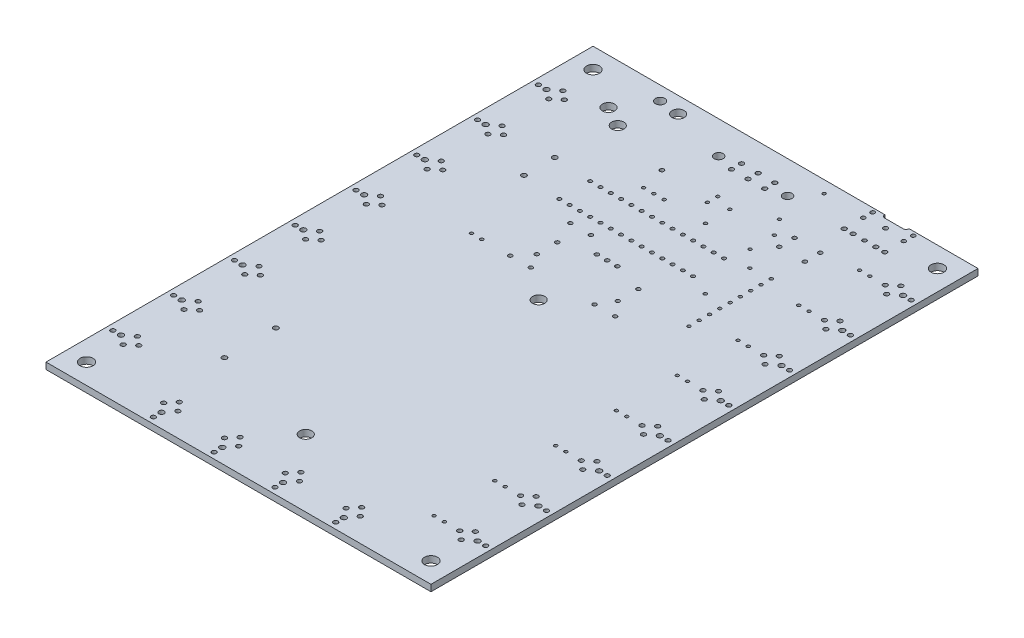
from build123d import *

# Parameters (mm, degrees)
ESQUISSE1_R      = 0.55118
ESQUISSE1_R_2    = 0.65024
ESQUISSE1_R_3    = 0.59944
ESQUISSE1_R_4    = 1.50114
ESQUISSE1_R_5    = 0.50038
ESQUISSE1_R_6    = 0.4826
ESQUISSE1_R_7    = 1.15062
ESQUISSE1_R_8    = 1.6002
ESQUISSE1_R_9    = 0.44958
ESQUISSE1_R_10   = 0.39878
ESQUISSE1_R_11   = 1.09982
EXTRUSION1_DEPTH = 1.6


with BuildPart() as part:
    # Esquisse1 → Extrusion1 (new body)
    with BuildSketch(Plane(origin=(0, 0, 0), x_dir=(1, 0, 0), z_dir=(0, 1, 0))):
        with BuildLine():
            Line((72.74814, 134.2517), (77.24902, 134.2517))
            ThreePointArc((77.24902, 134.2517), (77.77850144, 134.470811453), (77.998319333, 135))
            Line((77.998319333, 135), (95, 135))
            Line((95, 135), (95, 0))
            Line((95, 0), (0, 0))
            Line((0, 0), (0, 135))
            Line((0, 135), (71.998840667, 135))
            ThreePointArc((71.998840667, 135), (72.21865856, 134.470811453), (72.74814, 134.2517))
        make_face()
        with Locations(Location((24.99868, 1.4986, 0), (0, 0, 270))):
            Circle(ESQUISSE1_R, mode=Mode.SUBTRACT)
        with Locations(Location((24.99868, 7.8994, 0), (0, 0, 270))):
            Circle(ESQUISSE1_R, mode=Mode.SUBTRACT)
        with Locations(Location((26.74874, 5.79882, 0), (0, 0, 270))):
            Circle(ESQUISSE1_R, mode=Mode.SUBTRACT)
        with Locations(Location((23.24862, 5.79882, 0), (0, 0, 270))):
            Circle(ESQUISSE1_R, mode=Mode.SUBTRACT)
        with Locations(Location((24.99868, 3.50012, 0), (0, 0, 270))):
            Circle(ESQUISSE1_R_2, mode=Mode.SUBTRACT)
        with Locations(Location((39.99992, 1.4986, 0), (0, 0, 270))):
            Circle(ESQUISSE1_R, mode=Mode.SUBTRACT)
        with Locations(Location((39.99992, 7.8994, 0), (0, 0, 270))):
            Circle(ESQUISSE1_R, mode=Mode.SUBTRACT)
        with Locations(Location((41.74998, 5.79882, 0), (0, 0, 270))):
            Circle(ESQUISSE1_R, mode=Mode.SUBTRACT)
        with Locations(Location((38.24986, 5.79882, 0), (0, 0, 270))):
            Circle(ESQUISSE1_R, mode=Mode.SUBTRACT)
        with Locations(Location((39.99992, 3.50012, 0), (0, 0, 270))):
            Circle(ESQUISSE1_R_2, mode=Mode.SUBTRACT)
        with Locations(Location((54.99862, 1.4986, 0), (0, 0, 270))):
            Circle(ESQUISSE1_R, mode=Mode.SUBTRACT)
        with Locations(Location((54.99862, 7.8994, 0), (0, 0, 270))):
            Circle(ESQUISSE1_R, mode=Mode.SUBTRACT)
        with Locations(Location((56.74868, 5.79882, 0), (0, 0, 270))):
            Circle(ESQUISSE1_R, mode=Mode.SUBTRACT)
        with Locations(Location((53.24856, 5.79882, 0), (0, 0, 270))):
            Circle(ESQUISSE1_R, mode=Mode.SUBTRACT)
        with Locations(Location((54.99862, 3.50012, 0), (0, 0, 270))):
            Circle(ESQUISSE1_R_2, mode=Mode.SUBTRACT)
        with Locations(Location((69.99986, 1.4986, 0), (0, 0, 270))):
            Circle(ESQUISSE1_R, mode=Mode.SUBTRACT)
        with Locations(Location((69.99986, 7.8994, 0), (0, 0, 270))):
            Circle(ESQUISSE1_R, mode=Mode.SUBTRACT)
        with Locations(Location((71.74992, 5.79882, 0), (0, 0, 270))):
            Circle(ESQUISSE1_R, mode=Mode.SUBTRACT)
        with Locations(Location((68.2498, 5.79882, 0), (0, 0, 270))):
            Circle(ESQUISSE1_R, mode=Mode.SUBTRACT)
        with Locations(Location((69.99986, 3.50012, 0), (0, 0, 270))):
            Circle(ESQUISSE1_R_2, mode=Mode.SUBTRACT)
        with Locations(Location((21.07946, 35.6489, 0), (0, 0, 270))):
            Circle(ESQUISSE1_R_3, mode=Mode.SUBTRACT)
        with Locations(Location((21.07946, 22.9489, 0), (0, 0, 270))):
            Circle(ESQUISSE1_R_3, mode=Mode.SUBTRACT)
        with Locations(Location((47.50054, 16.5989, 0), (0, 0, 270))):
            Circle(ESQUISSE1_R_4, mode=Mode.SUBTRACT)
        with Locations(Location((72.1741, 118.90502, 0), (0, 0, 270))):
            Circle(ESQUISSE1_R_5, mode=Mode.SUBTRACT)
        with Locations(Location((72.1741, 115.09502, 0), (0, 0, 270))):
            Circle(ESQUISSE1_R_5, mode=Mode.SUBTRACT)
        with Locations(Location((65.8241, 115.09502, 0), (0, 0, 270))):
            Circle(ESQUISSE1_R_5, mode=Mode.SUBTRACT)
        with Locations(Location((65.8241, 118.90502, 0), (0, 0, 270))):
            Circle(ESQUISSE1_R_5, mode=Mode.SUBTRACT)
        with Locations(Location((40.0939, 94.3864, 0), (0, 0, 270))):
            Circle(ESQUISSE1_R_6, mode=Mode.SUBTRACT)
        with Locations(Location((35.0139, 94.3864, 0), (0, 0, 270))):
            Circle(ESQUISSE1_R_6, mode=Mode.SUBTRACT)
        with Locations(Location((60.452, 79.99222, 0), (0, 0, 270))):
            Circle(ESQUISSE1_R_6, mode=Mode.SUBTRACT)
        with Locations(Location((55.372, 79.99222, 0), (0, 0, 270))):
            Circle(ESQUISSE1_R_6, mode=Mode.SUBTRACT)
        with Locations(Location((34.54654, 80.00746, 0), (0, 0, 270))):
            Circle(ESQUISSE1_R_6, mode=Mode.SUBTRACT)
        with Locations(Location((39.62654, 80.00746, 0), (0, 0, 270))):
            Circle(ESQUISSE1_R_6, mode=Mode.SUBTRACT)
        with Locations(Location((57.50052, 83.59902, 0), (0, 0, 270))):
            Circle(ESQUISSE1_R_6, mode=Mode.SUBTRACT)
        with Locations(Location((57.50052, 88.67902, 0), (0, 0, 270))):
            Circle(ESQUISSE1_R_6, mode=Mode.SUBTRACT)
        with Locations(Location((37.50056, 83.59902, 0), (0, 0, 270))):
            Circle(ESQUISSE1_R_6, mode=Mode.SUBTRACT)
        with Locations(Location((37.50056, 88.67902, 0), (0, 0, 270))):
            Circle(ESQUISSE1_R_6, mode=Mode.SUBTRACT)
        with Locations(Location((19.99996, 121.09958, 0), (0, 0, 270))):
            Circle(ESQUISSE1_R_4, mode=Mode.SUBTRACT)
        with Locations(Location((15.00124, 123.7996, 0), (0, 0, 270))):
            Circle(ESQUISSE1_R_4, mode=Mode.SUBTRACT)
        with Locations(Location((25.00122, 131.0005, 0), (0, 0, 270))):
            Circle(ESQUISSE1_R_4, mode=Mode.SUBTRACT)
        with Locations(Location((19.99996, 131.54914, 0), (0, 0, 270))):
            Circle(ESQUISSE1_R_7, mode=Mode.SUBTRACT)
        with Locations(Location((19.07032, 98.8822, 0), (0, 0, 270))):
            Circle(ESQUISSE1_R_3, mode=Mode.SUBTRACT)
        with Locations(Location((19.07032, 106.5022, 0), (0, 0, 270))):
            Circle(ESQUISSE1_R_3, mode=Mode.SUBTRACT)
        with Locations(Location((5.00126, 5.00126, 0), (0, 0, 270))):
            Circle(ESQUISSE1_R_8, mode=Mode.SUBTRACT)
        with Locations(Location((5.00126, 129.99974, 0), (0, 0, 270))):
            Circle(ESQUISSE1_R_8, mode=Mode.SUBTRACT)
        with Locations(Location((89.99982, 129.99974, 0), (0, 0, 270))):
            Circle(ESQUISSE1_R_8, mode=Mode.SUBTRACT)
        with Locations(Location((89.99982, 5.00126, 0), (0, 0, 270))):
            Circle(ESQUISSE1_R_8, mode=Mode.SUBTRACT)
        with Locations(Location((61.51118, 105.80878, 0), (0, 0, 270))):
            Circle(ESQUISSE1_R_9, mode=Mode.SUBTRACT)
        with Locations(Location((58.97118, 105.80878, 0), (0, 0, 270))):
            Circle(ESQUISSE1_R_9, mode=Mode.SUBTRACT)
        with Locations(Location((56.43118, 105.80878, 0), (0, 0, 270))):
            Circle(ESQUISSE1_R_9, mode=Mode.SUBTRACT)
        with Locations(Location((53.89118, 105.80878, 0), (0, 0, 270))):
            Circle(ESQUISSE1_R_9, mode=Mode.SUBTRACT)
        with Locations(Location((51.35118, 105.80878, 0), (0, 0, 270))):
            Circle(ESQUISSE1_R_9, mode=Mode.SUBTRACT)
        with Locations(Location((48.81118, 105.80878, 0), (0, 0, 270))):
            Circle(ESQUISSE1_R_9, mode=Mode.SUBTRACT)
        with Locations(Location((46.27118, 105.80878, 0), (0, 0, 270))):
            Circle(ESQUISSE1_R_9, mode=Mode.SUBTRACT)
        with Locations(Location((43.73118, 105.80878, 0), (0, 0, 270))):
            Circle(ESQUISSE1_R_9, mode=Mode.SUBTRACT)
        with Locations(Location((41.19118, 105.80878, 0), (0, 0, 270))):
            Circle(ESQUISSE1_R_9, mode=Mode.SUBTRACT)
        with Locations(Location((38.65118, 105.80878, 0), (0, 0, 270))):
            Circle(ESQUISSE1_R_9, mode=Mode.SUBTRACT)
        with Locations(Location((36.11118, 105.80878, 0), (0, 0, 270))):
            Circle(ESQUISSE1_R_9, mode=Mode.SUBTRACT)
        with Locations(Location((33.57118, 105.80878, 0), (0, 0, 270))):
            Circle(ESQUISSE1_R_9, mode=Mode.SUBTRACT)
        with Locations(Location((31.03118, 105.80878, 0), (0, 0, 270))):
            Circle(ESQUISSE1_R_9, mode=Mode.SUBTRACT)
        with Locations(Location((28.49118, 105.80878, 0), (0, 0, 270))):
            Circle(ESQUISSE1_R_9, mode=Mode.SUBTRACT)
        with Locations(Location((28.49118, 98.18878, 0), (0, 0, 270))):
            Circle(ESQUISSE1_R_9, mode=Mode.SUBTRACT)
        with Locations(Location((31.03118, 98.18878, 0), (0, 0, 270))):
            Circle(ESQUISSE1_R_9, mode=Mode.SUBTRACT)
        with Locations(Location((33.57118, 98.18878, 0), (0, 0, 270))):
            Circle(ESQUISSE1_R_9, mode=Mode.SUBTRACT)
        with Locations(Location((36.11118, 98.18878, 0), (0, 0, 270))):
            Circle(ESQUISSE1_R_9, mode=Mode.SUBTRACT)
        with Locations(Location((38.65118, 98.18878, 0), (0, 0, 270))):
            Circle(ESQUISSE1_R_9, mode=Mode.SUBTRACT)
        with Locations(Location((41.19118, 98.18878, 0), (0, 0, 270))):
            Circle(ESQUISSE1_R_9, mode=Mode.SUBTRACT)
        with Locations(Location((43.73118, 98.18878, 0), (0, 0, 270))):
            Circle(ESQUISSE1_R_9, mode=Mode.SUBTRACT)
        with Locations(Location((46.27118, 98.18878, 0), (0, 0, 270))):
            Circle(ESQUISSE1_R_9, mode=Mode.SUBTRACT)
        with Locations(Location((48.81118, 98.18878, 0), (0, 0, 270))):
            Circle(ESQUISSE1_R_9, mode=Mode.SUBTRACT)
        with Locations(Location((51.35118, 98.18878, 0), (0, 0, 270))):
            Circle(ESQUISSE1_R_9, mode=Mode.SUBTRACT)
        with Locations(Location((53.89118, 98.18878, 0), (0, 0, 270))):
            Circle(ESQUISSE1_R_9, mode=Mode.SUBTRACT)
        with Locations(Location((56.43118, 98.18878, 0), (0, 0, 270))):
            Circle(ESQUISSE1_R_9, mode=Mode.SUBTRACT)
        with Locations(Location((58.97118, 98.18878, 0), (0, 0, 270))):
            Circle(ESQUISSE1_R_9, mode=Mode.SUBTRACT)
        with Locations(Location((61.51118, 98.18878, 0), (0, 0, 270))):
            Circle(ESQUISSE1_R_9, mode=Mode.SUBTRACT)
        with Locations(Location((1.4986, 15.00124, 0), (0, 0, 270))):
            Circle(ESQUISSE1_R, mode=Mode.SUBTRACT)
        with Locations(Location((7.8994, 15.00124, 0), (0, 0, 270))):
            Circle(ESQUISSE1_R, mode=Mode.SUBTRACT)
        with Locations(Location((5.79882, 13.25118, 0), (0, 0, 270))):
            Circle(ESQUISSE1_R, mode=Mode.SUBTRACT)
        with Locations(Location((5.79882, 16.7513, 0), (0, 0, 270))):
            Circle(ESQUISSE1_R, mode=Mode.SUBTRACT)
        with Locations(Location((3.50012, 15.00124, 0), (0, 0, 270))):
            Circle(ESQUISSE1_R_2, mode=Mode.SUBTRACT)
        with Locations(Location((1.4986, 29.99994, 0), (0, 0, 270))):
            Circle(ESQUISSE1_R, mode=Mode.SUBTRACT)
        with Locations(Location((7.8994, 29.99994, 0), (0, 0, 270))):
            Circle(ESQUISSE1_R, mode=Mode.SUBTRACT)
        with Locations(Location((5.79882, 28.24988, 0), (0, 0, 270))):
            Circle(ESQUISSE1_R, mode=Mode.SUBTRACT)
        with Locations(Location((5.79882, 31.75, 0), (0, 0, 270))):
            Circle(ESQUISSE1_R, mode=Mode.SUBTRACT)
        with Locations(Location((3.50012, 30.00248, 0), (0, 0, 270))):
            Circle(ESQUISSE1_R_2, mode=Mode.SUBTRACT)
        with Locations(Location((1.4986, 45.00118, 0), (0, 0, 270))):
            Circle(ESQUISSE1_R, mode=Mode.SUBTRACT)
        with Locations(Location((7.8994, 45.00118, 0), (0, 0, 270))):
            Circle(ESQUISSE1_R, mode=Mode.SUBTRACT)
        with Locations(Location((5.79882, 43.25112, 0), (0, 0, 270))):
            Circle(ESQUISSE1_R, mode=Mode.SUBTRACT)
        with Locations(Location((5.79882, 46.75124, 0), (0, 0, 270))):
            Circle(ESQUISSE1_R, mode=Mode.SUBTRACT)
        with Locations(Location((3.50012, 45.00118, 0), (0, 0, 270))):
            Circle(ESQUISSE1_R_2, mode=Mode.SUBTRACT)
        with Locations(Location((1.4986, 59.99988, 0), (0, 0, 270))):
            Circle(ESQUISSE1_R, mode=Mode.SUBTRACT)
        with Locations(Location((7.8994, 59.99988, 0), (0, 0, 270))):
            Circle(ESQUISSE1_R, mode=Mode.SUBTRACT)
        with Locations(Location((5.79882, 58.24982, 0), (0, 0, 270))):
            Circle(ESQUISSE1_R, mode=Mode.SUBTRACT)
        with Locations(Location((5.79882, 61.74994, 0), (0, 0, 270))):
            Circle(ESQUISSE1_R, mode=Mode.SUBTRACT)
        with Locations(Location((3.50012, 60.00242, 0), (0, 0, 270))):
            Circle(ESQUISSE1_R_2, mode=Mode.SUBTRACT)
        with Locations(Location((1.4986, 75.00112, 0), (0, 0, 270))):
            Circle(ESQUISSE1_R, mode=Mode.SUBTRACT)
        with Locations(Location((7.8994, 75.00112, 0), (0, 0, 270))):
            Circle(ESQUISSE1_R, mode=Mode.SUBTRACT)
        with Locations(Location((5.79882, 73.25106, 0), (0, 0, 270))):
            Circle(ESQUISSE1_R, mode=Mode.SUBTRACT)
        with Locations(Location((5.79882, 76.75118, 0), (0, 0, 270))):
            Circle(ESQUISSE1_R, mode=Mode.SUBTRACT)
        with Locations(Location((3.50012, 75.00112, 0), (0, 0, 270))):
            Circle(ESQUISSE1_R_2, mode=Mode.SUBTRACT)
        with Locations(Location((1.4986, 89.99982, 0), (0, 0, 270))):
            Circle(ESQUISSE1_R, mode=Mode.SUBTRACT)
        with Locations(Location((7.8994, 89.99982, 0), (0, 0, 270))):
            Circle(ESQUISSE1_R, mode=Mode.SUBTRACT)
        with Locations(Location((5.79882, 88.24976, 0), (0, 0, 270))):
            Circle(ESQUISSE1_R, mode=Mode.SUBTRACT)
        with Locations(Location((5.79882, 91.74988, 0), (0, 0, 270))):
            Circle(ESQUISSE1_R, mode=Mode.SUBTRACT)
        with Locations(Location((3.50012, 90.00236, 0), (0, 0, 270))):
            Circle(ESQUISSE1_R_2, mode=Mode.SUBTRACT)
        with Locations(Location((1.4986, 105.00106, 0), (0, 0, 270))):
            Circle(ESQUISSE1_R, mode=Mode.SUBTRACT)
        with Locations(Location((7.8994, 105.00106, 0), (0, 0, 270))):
            Circle(ESQUISSE1_R, mode=Mode.SUBTRACT)
        with Locations(Location((5.79882, 103.251, 0), (0, 0, 270))):
            Circle(ESQUISSE1_R, mode=Mode.SUBTRACT)
        with Locations(Location((5.79882, 106.75112, 0), (0, 0, 270))):
            Circle(ESQUISSE1_R, mode=Mode.SUBTRACT)
        with Locations(Location((3.50012, 105.00106, 0), (0, 0, 270))):
            Circle(ESQUISSE1_R_2, mode=Mode.SUBTRACT)
        with Locations(Location((1.4986, 119.99976, 0), (0, 0, 270))):
            Circle(ESQUISSE1_R, mode=Mode.SUBTRACT)
        with Locations(Location((7.8994, 119.99976, 0), (0, 0, 270))):
            Circle(ESQUISSE1_R, mode=Mode.SUBTRACT)
        with Locations(Location((5.79882, 118.25224, 0), (0, 0, 270))):
            Circle(ESQUISSE1_R, mode=Mode.SUBTRACT)
        with Locations(Location((5.79882, 121.74982, 0), (0, 0, 270))):
            Circle(ESQUISSE1_R, mode=Mode.SUBTRACT)
        with Locations(Location((3.50012, 120.0023, 0), (0, 0, 270))):
            Circle(ESQUISSE1_R_2, mode=Mode.SUBTRACT)
        with Locations(Location((25.00122, 79.99984, 0), (0, 0, 270))):
            Circle(ESQUISSE1_R_10, mode=Mode.SUBTRACT)
        with Locations(Location((27.54122, 79.99984, 0), (0, 0, 270))):
            Circle(ESQUISSE1_R_10, mode=Mode.SUBTRACT)
        with Locations(Location((74.99858, 132.19176, 0), (0, 0, 270))):
            Circle(ESQUISSE1_R, mode=Mode.SUBTRACT)
        with Locations(Location((79.9973, 126.99238, 0), (0, 0, 270))):
            Circle(ESQUISSE1_R, mode=Mode.SUBTRACT)
        with Locations(Location((77.79766, 126.99238, 0), (0, 0, 270))):
            Circle(ESQUISSE1_R, mode=Mode.SUBTRACT)
        with Locations(Location((72.19696, 126.99238, 0), (0, 0, 270))):
            Circle(ESQUISSE1_R, mode=Mode.SUBTRACT)
        with Locations(Location((69.99732, 126.99238, 0), (0, 0, 270))):
            Circle(ESQUISSE1_R, mode=Mode.SUBTRACT)
        with Locations(Location((74.99858, 126.99238, 0), (0, 0, 270))):
            Circle(ESQUISSE1_R_5, mode=Mode.SUBTRACT)
        with Locations(Location((79.9973, 133.99262, 0), (0, 0, 270))):
            Circle(ESQUISSE1_R_5, mode=Mode.SUBTRACT)
        with Locations(Location((79.9973, 131.69138, 0), (0, 0, 270))):
            Circle(ESQUISSE1_R_5, mode=Mode.SUBTRACT)
        with Locations(Location((69.99732, 133.99262, 0), (0, 0, 270))):
            Circle(ESQUISSE1_R_5, mode=Mode.SUBTRACT)
        with Locations(Location((69.99732, 131.69138, 0), (0, 0, 270))):
            Circle(ESQUISSE1_R_5, mode=Mode.SUBTRACT)
        with Locations(Location((83.28914, 15.01902, 0), (0, 0, 270))):
            Circle(ESQUISSE1_R_10, mode=Mode.SUBTRACT)
        with Locations(Location((80.74914, 15.01902, 0), (0, 0, 270))):
            Circle(ESQUISSE1_R_10, mode=Mode.SUBTRACT)
        with Locations(Location((83.28914, 30.01772, 0), (0, 0, 270))):
            Circle(ESQUISSE1_R_10, mode=Mode.SUBTRACT)
        with Locations(Location((80.74914, 30.01772, 0), (0, 0, 270))):
            Circle(ESQUISSE1_R_10, mode=Mode.SUBTRACT)
        with Locations(Location((83.28914, 45.01896, 0), (0, 0, 270))):
            Circle(ESQUISSE1_R_10, mode=Mode.SUBTRACT)
        with Locations(Location((80.74914, 45.01896, 0), (0, 0, 270))):
            Circle(ESQUISSE1_R_10, mode=Mode.SUBTRACT)
        with Locations(Location((83.28914, 60.01766, 0), (0, 0, 270))):
            Circle(ESQUISSE1_R_10, mode=Mode.SUBTRACT)
        with Locations(Location((80.74914, 60.01766, 0), (0, 0, 270))):
            Circle(ESQUISSE1_R_10, mode=Mode.SUBTRACT)
        with Locations(Location((83.28914, 75.0189, 0), (0, 0, 270))):
            Circle(ESQUISSE1_R_10, mode=Mode.SUBTRACT)
        with Locations(Location((80.74914, 75.0189, 0), (0, 0, 270))):
            Circle(ESQUISSE1_R_10, mode=Mode.SUBTRACT)
        with Locations(Location((83.28914, 90.0176, 0), (0, 0, 270))):
            Circle(ESQUISSE1_R_10, mode=Mode.SUBTRACT)
        with Locations(Location((80.74914, 90.0176, 0), (0, 0, 270))):
            Circle(ESQUISSE1_R_10, mode=Mode.SUBTRACT)
        with Locations(Location((83.28914, 105.01884, 0), (0, 0, 270))):
            Circle(ESQUISSE1_R_10, mode=Mode.SUBTRACT)
        with Locations(Location((80.74914, 105.01884, 0), (0, 0, 270))):
            Circle(ESQUISSE1_R_10, mode=Mode.SUBTRACT)
        with Locations(Location((83.28914, 120.01754, 0), (0, 0, 270))):
            Circle(ESQUISSE1_R_10, mode=Mode.SUBTRACT)
        with Locations(Location((80.74914, 120.01754, 0), (0, 0, 270))):
            Circle(ESQUISSE1_R_10, mode=Mode.SUBTRACT)
        with Locations(Location((47.50054, 115.73002, 0), (0, 0, 270))):
            Circle(ESQUISSE1_R_10, mode=Mode.SUBTRACT)
        with Locations(Location((47.50054, 118.27002, 0), (0, 0, 270))):
            Circle(ESQUISSE1_R_10, mode=Mode.SUBTRACT)
        with Locations(Location((93.49994, 14.9987, 0), (0, 0, 270))):
            Circle(ESQUISSE1_R, mode=Mode.SUBTRACT)
        with Locations(Location((87.10168, 14.9987, 0), (0, 0, 270))):
            Circle(ESQUISSE1_R, mode=Mode.SUBTRACT)
        with Locations(Location((89.20226, 16.74876, 0), (0, 0, 270))):
            Circle(ESQUISSE1_R, mode=Mode.SUBTRACT)
        with Locations(Location((89.20226, 13.24864, 0), (0, 0, 270))):
            Circle(ESQUISSE1_R, mode=Mode.SUBTRACT)
        with Locations(Location((91.50096, 14.9987, 0), (0, 0, 270))):
            Circle(ESQUISSE1_R_2, mode=Mode.SUBTRACT)
        with Locations(Location((93.49994, 29.99994, 0), (0, 0, 270))):
            Circle(ESQUISSE1_R, mode=Mode.SUBTRACT)
        with Locations(Location((87.10168, 29.99994, 0), (0, 0, 270))):
            Circle(ESQUISSE1_R, mode=Mode.SUBTRACT)
        with Locations(Location((89.20226, 31.75, 0), (0, 0, 270))):
            Circle(ESQUISSE1_R, mode=Mode.SUBTRACT)
        with Locations(Location((89.20226, 28.24988, 0), (0, 0, 270))):
            Circle(ESQUISSE1_R, mode=Mode.SUBTRACT)
        with Locations(Location((91.50096, 29.99994, 0), (0, 0, 270))):
            Circle(ESQUISSE1_R_2, mode=Mode.SUBTRACT)
        with Locations(Location((93.49994, 44.99864, 0), (0, 0, 270))):
            Circle(ESQUISSE1_R, mode=Mode.SUBTRACT)
        with Locations(Location((87.10168, 44.99864, 0), (0, 0, 270))):
            Circle(ESQUISSE1_R, mode=Mode.SUBTRACT)
        with Locations(Location((89.20226, 46.7487, 0), (0, 0, 270))):
            Circle(ESQUISSE1_R, mode=Mode.SUBTRACT)
        with Locations(Location((89.20226, 43.24858, 0), (0, 0, 270))):
            Circle(ESQUISSE1_R, mode=Mode.SUBTRACT)
        with Locations(Location((91.50096, 44.99864, 0), (0, 0, 270))):
            Circle(ESQUISSE1_R_2, mode=Mode.SUBTRACT)
        with Locations(Location((93.49994, 59.99988, 0), (0, 0, 270))):
            Circle(ESQUISSE1_R, mode=Mode.SUBTRACT)
        with Locations(Location((87.10168, 59.99988, 0), (0, 0, 270))):
            Circle(ESQUISSE1_R, mode=Mode.SUBTRACT)
        with Locations(Location((89.20226, 61.74994, 0), (0, 0, 270))):
            Circle(ESQUISSE1_R, mode=Mode.SUBTRACT)
        with Locations(Location((89.20226, 58.24982, 0), (0, 0, 270))):
            Circle(ESQUISSE1_R, mode=Mode.SUBTRACT)
        with Locations(Location((91.50096, 59.99988, 0), (0, 0, 270))):
            Circle(ESQUISSE1_R_2, mode=Mode.SUBTRACT)
        with Locations(Location((93.49994, 74.99858, 0), (0, 0, 270))):
            Circle(ESQUISSE1_R, mode=Mode.SUBTRACT)
        with Locations(Location((87.10168, 74.99858, 0), (0, 0, 270))):
            Circle(ESQUISSE1_R, mode=Mode.SUBTRACT)
        with Locations(Location((89.20226, 76.74864, 0), (0, 0, 270))):
            Circle(ESQUISSE1_R, mode=Mode.SUBTRACT)
        with Locations(Location((89.20226, 73.24852, 0), (0, 0, 270))):
            Circle(ESQUISSE1_R, mode=Mode.SUBTRACT)
        with Locations(Location((91.50096, 74.99858, 0), (0, 0, 270))):
            Circle(ESQUISSE1_R_2, mode=Mode.SUBTRACT)
        with Locations(Location((93.49994, 89.99982, 0), (0, 0, 270))):
            Circle(ESQUISSE1_R, mode=Mode.SUBTRACT)
        with Locations(Location((87.10168, 89.99982, 0), (0, 0, 270))):
            Circle(ESQUISSE1_R, mode=Mode.SUBTRACT)
        with Locations(Location((89.20226, 91.74988, 0), (0, 0, 270))):
            Circle(ESQUISSE1_R, mode=Mode.SUBTRACT)
        with Locations(Location((89.20226, 88.24976, 0), (0, 0, 270))):
            Circle(ESQUISSE1_R, mode=Mode.SUBTRACT)
        with Locations(Location((91.50096, 89.99982, 0), (0, 0, 270))):
            Circle(ESQUISSE1_R_2, mode=Mode.SUBTRACT)
        with Locations(Location((93.49994, 104.99852, 0), (0, 0, 270))):
            Circle(ESQUISSE1_R, mode=Mode.SUBTRACT)
        with Locations(Location((87.10168, 104.99852, 0), (0, 0, 270))):
            Circle(ESQUISSE1_R, mode=Mode.SUBTRACT)
        with Locations(Location((89.20226, 106.74858, 0), (0, 0, 270))):
            Circle(ESQUISSE1_R, mode=Mode.SUBTRACT)
        with Locations(Location((89.20226, 103.24846, 0), (0, 0, 270))):
            Circle(ESQUISSE1_R, mode=Mode.SUBTRACT)
        with Locations(Location((91.50096, 104.99852, 0), (0, 0, 270))):
            Circle(ESQUISSE1_R_2, mode=Mode.SUBTRACT)
        with Locations(Location((93.49994, 119.99976, 0), (0, 0, 270))):
            Circle(ESQUISSE1_R, mode=Mode.SUBTRACT)
        with Locations(Location((87.10168, 119.99976, 0), (0, 0, 270))):
            Circle(ESQUISSE1_R, mode=Mode.SUBTRACT)
        with Locations(Location((89.20226, 121.74982, 0), (0, 0, 270))):
            Circle(ESQUISSE1_R, mode=Mode.SUBTRACT)
        with Locations(Location((89.20226, 118.2497, 0), (0, 0, 270))):
            Circle(ESQUISSE1_R, mode=Mode.SUBTRACT)
        with Locations(Location((91.50096, 119.99976, 0), (0, 0, 270))):
            Circle(ESQUISSE1_R_2, mode=Mode.SUBTRACT)
        with Locations(Location((36.45916, 111.00054, 0), (0, 0, 270))):
            Circle(ESQUISSE1_R_10, mode=Mode.SUBTRACT)
        with Locations(Location((38.99916, 111.00054, 0), (0, 0, 270))):
            Circle(ESQUISSE1_R_10, mode=Mode.SUBTRACT)
        with Locations(Location((41.53916, 111.00054, 0), (0, 0, 270))):
            Circle(ESQUISSE1_R_10, mode=Mode.SUBTRACT)
        with Locations(Location((66.76136, 95.92818, 0), (0, 0, 270))):
            Circle(ESQUISSE1_R_10, mode=Mode.SUBTRACT)
        with Locations(Location((66.76136, 106.92892, 0), (0, 0, 270))):
            Circle(ESQUISSE1_R_10, mode=Mode.SUBTRACT)
        with Locations(Location((59.99988, 121.00052, 0), (0, 0, 270))):
            Circle(ESQUISSE1_R_10, mode=Mode.SUBTRACT)
        with Locations(Location((59.99988, 132.00126, 0), (0, 0, 270))):
            Circle(ESQUISSE1_R_10, mode=Mode.SUBTRACT)
        with Locations(Location((51.74996, 117.00002, 0), (0, 0, 270))):
            Circle(ESQUISSE1_R_10, mode=Mode.SUBTRACT)
        with Locations(Location((62.7507, 117.00002, 0), (0, 0, 270))):
            Circle(ESQUISSE1_R_10, mode=Mode.SUBTRACT)
        with Locations(Location((62.7507, 111.00054, 0), (0, 0, 270))):
            Circle(ESQUISSE1_R_10, mode=Mode.SUBTRACT)
        with Locations(Location((51.74996, 111.00054, 0), (0, 0, 270))):
            Circle(ESQUISSE1_R_10, mode=Mode.SUBTRACT)
        with Locations(Location((50.04054, 90.97518, 0), (0, 0, 270))):
            Circle(ESQUISSE1_R_5, mode=Mode.SUBTRACT)
        with Locations(Location((47.50054, 90.97518, 0), (0, 0, 270))):
            Circle(ESQUISSE1_R_5, mode=Mode.SUBTRACT)
        with Locations(Location((44.96054, 90.97518, 0), (0, 0, 270))):
            Circle(ESQUISSE1_R_5, mode=Mode.SUBTRACT)
        with Locations(Location((47.50054, 74.07402, 0), (0, 0, 270))):
            Circle(ESQUISSE1_R_4, mode=Mode.SUBTRACT)
        with Locations(Location((71.69912, 86.96706, 0), (0, 0, 270))):
            Circle(ESQUISSE1_R_10, mode=Mode.SUBTRACT)
        with Locations(Location((71.69912, 89.50706, 0), (0, 0, 270))):
            Circle(ESQUISSE1_R_10, mode=Mode.SUBTRACT)
        with Locations(Location((71.69912, 92.04706, 0), (0, 0, 270))):
            Circle(ESQUISSE1_R_10, mode=Mode.SUBTRACT)
        with Locations(Location((71.69912, 94.58706, 0), (0, 0, 270))):
            Circle(ESQUISSE1_R_10, mode=Mode.SUBTRACT)
        with Locations(Location((71.69912, 97.12706, 0), (0, 0, 270))):
            Circle(ESQUISSE1_R_10, mode=Mode.SUBTRACT)
        with Locations(Location((71.69912, 99.66706, 0), (0, 0, 270))):
            Circle(ESQUISSE1_R_10, mode=Mode.SUBTRACT)
        with Locations(Location((71.69912, 102.20706, 0), (0, 0, 270))):
            Circle(ESQUISSE1_R_10, mode=Mode.SUBTRACT)
        with Locations(Location((71.69912, 104.74706, 0), (0, 0, 270))):
            Circle(ESQUISSE1_R_10, mode=Mode.SUBTRACT)
        with Locations(Location((71.69912, 107.28706, 0), (0, 0, 270))):
            Circle(ESQUISSE1_R_10, mode=Mode.SUBTRACT)
        with Locations(Location((47.50054, 128.24968, 0), (0, 0, 270))):
            Circle(ESQUISSE1_R, mode=Mode.SUBTRACT)
        with Locations(Location((43.40098, 128.24968, 0), (0, 0, 270))):
            Circle(ESQUISSE1_R, mode=Mode.SUBTRACT)
        with Locations(Location((47.50054, 125.75032, 0), (0, 0, 270))):
            Circle(ESQUISSE1_R, mode=Mode.SUBTRACT)
        with Locations(Location((43.40098, 125.75032, 0), (0, 0, 270))):
            Circle(ESQUISSE1_R, mode=Mode.SUBTRACT)
        with Locations(Location((51.6001, 128.24968, 0), (0, 0, 270))):
            Circle(ESQUISSE1_R, mode=Mode.SUBTRACT)
        with Locations(Location((51.6001, 125.75032, 0), (0, 0, 270))):
            Circle(ESQUISSE1_R, mode=Mode.SUBTRACT)
        with Locations(Location((55.99938, 127, 0), (0, 0, 270))):
            Circle(ESQUISSE1_R_11, mode=Mode.SUBTRACT)
        with Locations(Location((38.99916, 127, 0), (0, 0, 270))):
            Circle(ESQUISSE1_R_11, mode=Mode.SUBTRACT)
        with Locations(Location((35.0012, 117.00002, 0), (0, 0, 270))):
            Circle(ESQUISSE1_R_5, mode=Mode.SUBTRACT)
    extrude(amount=EXTRUSION1_DEPTH)


solid = part.part
